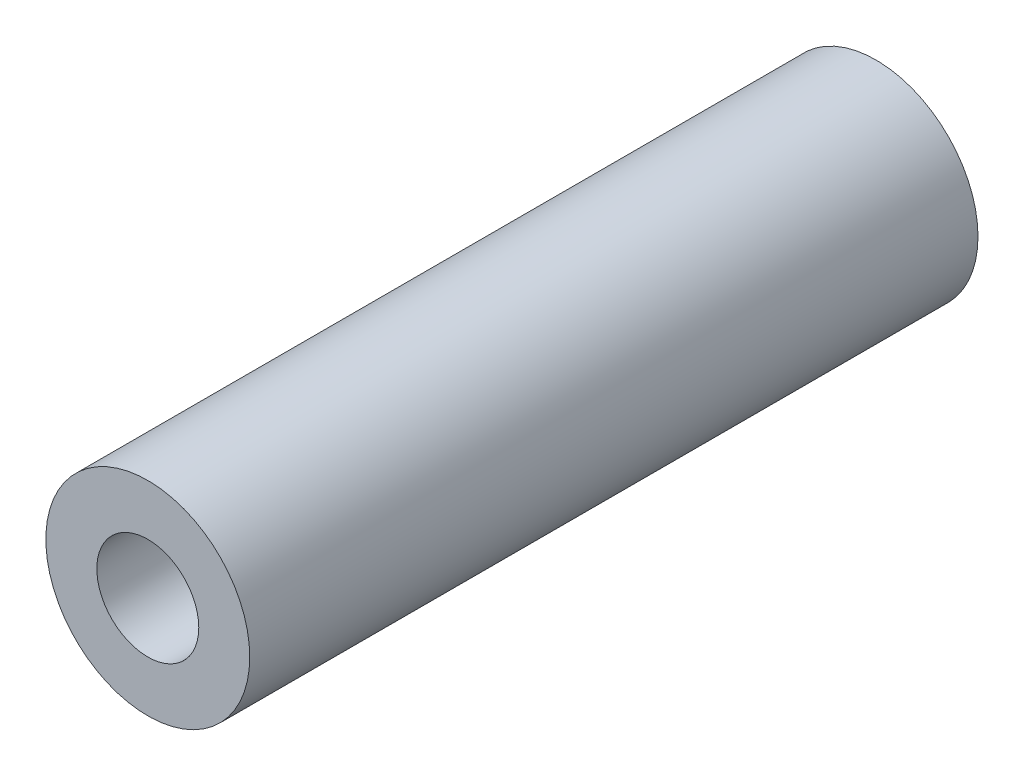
ISO-10303-21;
HEADER;
FILE_DESCRIPTION(('STEP AP214'),'2;1');
FILE_NAME('part.step','',(''),(''),'','','');
FILE_SCHEMA(('AUTOMOTIVE_DESIGN { 1 0 10303 214 1 1 1 1 }'));
ENDSEC;
DATA;
#1=APPLICATION_CONTEXT('core data for automotive mechanical design processes');
#2=APPLICATION_PROTOCOL_DEFINITION('international standard','automotive_design',2000,#1);
#3=PRODUCT_CONTEXT('',#1,'mechanical');
#4=PRODUCT('Part','Part','',(#3));
#5=PRODUCT_RELATED_PRODUCT_CATEGORY('part','',(#4));
#6=PRODUCT_DEFINITION_FORMATION('','',#4);
#7=PRODUCT_DEFINITION_CONTEXT('part definition',#1,'design');
#8=PRODUCT_DEFINITION('design','',#6,#7);
#9=PRODUCT_DEFINITION_SHAPE('','',#8);
#10=(LENGTH_UNIT() NAMED_UNIT(*) SI_UNIT(.MILLI.,.METRE.));
#11=(NAMED_UNIT(*) PLANE_ANGLE_UNIT() SI_UNIT($,.RADIAN.));
#12=(NAMED_UNIT(*) SI_UNIT($,.STERADIAN.) SOLID_ANGLE_UNIT());
#13=UNCERTAINTY_MEASURE_WITH_UNIT(LENGTH_MEASURE(1.E-05),#10,'distance_accuracy_value','');
#14=(GEOMETRIC_REPRESENTATION_CONTEXT(3) GLOBAL_UNCERTAINTY_ASSIGNED_CONTEXT((#13)) GLOBAL_UNIT_ASSIGNED_CONTEXT((#10,
#11,#12)) REPRESENTATION_CONTEXT('',''));
#15=CARTESIAN_POINT('',(0.,0.,0.));
#16=DIRECTION('',(0.,0.,1.));
#17=DIRECTION('',(1.,0.,0.));
#18=AXIS2_PLACEMENT_3D('',#15,#16,#17);
#19=CARTESIAN_POINT('',(0.,0.,25.));
#20=DIRECTION('',(0.,0.,-1.));
#21=DIRECTION('',(-1.,0.,0.));
#22=AXIS2_PLACEMENT_3D('',#19,#20,#21);
#23=CYLINDRICAL_SURFACE('',#22,3.5);
#24=CARTESIAN_POINT('',(0.,0.,25.));
#25=DIRECTION('',(0.,0.,1.));
#26=DIRECTION('',(1.,0.,0.));
#27=AXIS2_PLACEMENT_3D('',#24,#25,#26);
#28=CIRCLE('',#27,3.5);
#29=CARTESIAN_POINT('',(3.5,0.,25.));
#30=VERTEX_POINT('',#29);
#31=EDGE_CURVE('E10',#30,#30,#28,.T.);
#32=ORIENTED_EDGE('',*,*,#31,.F.);
#33=EDGE_LOOP('',(#32));
#34=FACE_BOUND('',#33,.T.);
#35=CARTESIAN_POINT('',(0.,0.,0.));
#36=DIRECTION('',(0.,0.,1.));
#37=DIRECTION('',(1.,0.,0.));
#38=AXIS2_PLACEMENT_3D('',#35,#36,#37);
#39=CIRCLE('',#38,3.5);
#40=CARTESIAN_POINT('',(3.5,0.,0.));
#41=VERTEX_POINT('',#40);
#42=EDGE_CURVE('E30',#41,#41,#39,.T.);
#43=ORIENTED_EDGE('',*,*,#42,.T.);
#44=EDGE_LOOP('',(#43));
#45=FACE_BOUND('',#44,.T.);
#46=ADVANCED_FACE('F24',(#34,#45),#23,.T.);
#47=CARTESIAN_POINT('',(0.,0.,25.));
#48=DIRECTION('',(0.,0.,1.));
#49=DIRECTION('',(1.,0.,0.));
#50=AXIS2_PLACEMENT_3D('',#47,#48,#49);
#51=PLANE('',#50);
#52=CARTESIAN_POINT('',(0.,0.,25.));
#53=DIRECTION('',(0.,0.,1.));
#54=DIRECTION('',(1.,0.,0.));
#55=AXIS2_PLACEMENT_3D('',#52,#53,#54);
#56=CIRCLE('',#55,1.75);
#57=CARTESIAN_POINT('',(1.75,0.,25.));
#58=VERTEX_POINT('',#57);
#59=EDGE_CURVE('E38',#58,#58,#56,.T.);
#60=ORIENTED_EDGE('',*,*,#59,.F.);
#61=EDGE_LOOP('',(#60));
#62=FACE_BOUND('',#61,.T.);
#63=ORIENTED_EDGE('',*,*,#31,.T.);
#64=EDGE_LOOP('',(#63));
#65=FACE_BOUND('',#64,.T.);
#66=ADVANCED_FACE('F46',(#62,#65),#51,.T.);
#67=CARTESIAN_POINT('',(0.,0.,0.));
#68=DIRECTION('',(0.,0.,1.));
#69=DIRECTION('',(1.,0.,0.));
#70=AXIS2_PLACEMENT_3D('',#67,#68,#69);
#71=PLANE('',#70);
#72=CARTESIAN_POINT('',(0.,0.,0.));
#73=DIRECTION('',(0.,0.,1.));
#74=DIRECTION('',(1.,0.,0.));
#75=AXIS2_PLACEMENT_3D('',#72,#73,#74);
#76=CIRCLE('',#75,1.75);
#77=CARTESIAN_POINT('',(1.75,0.,0.));
#78=VERTEX_POINT('',#77);
#79=EDGE_CURVE('E34',#78,#78,#76,.T.);
#80=ORIENTED_EDGE('',*,*,#79,.T.);
#81=EDGE_LOOP('',(#80));
#82=FACE_BOUND('',#81,.T.);
#83=ORIENTED_EDGE('',*,*,#42,.F.);
#84=EDGE_LOOP('',(#83));
#85=FACE_BOUND('',#84,.T.);
#86=ADVANCED_FACE('F48',(#82,#85),#71,.F.);
#87=CARTESIAN_POINT('',(0.,0.,0.));
#88=DIRECTION('',(0.,0.,1.));
#89=DIRECTION('',(1.,0.,0.));
#90=AXIS2_PLACEMENT_3D('',#87,#88,#89);
#91=CYLINDRICAL_SURFACE('',#90,1.75);
#92=ORIENTED_EDGE('',*,*,#79,.F.);
#93=EDGE_LOOP('',(#92));
#94=FACE_BOUND('',#93,.T.);
#95=ORIENTED_EDGE('',*,*,#59,.T.);
#96=EDGE_LOOP('',(#95));
#97=FACE_BOUND('',#96,.T.);
#98=ADVANCED_FACE('F44',(#94,#97),#91,.F.);
#99=CLOSED_SHELL('',(#46,#66,#86,#98));
#100=MANIFOLD_SOLID_BREP('B2',#99);
#101=ADVANCED_BREP_SHAPE_REPRESENTATION('',(#18,#100),#14);
#102=SHAPE_DEFINITION_REPRESENTATION(#9,#101);
ENDSEC;
END-ISO-10303-21;
